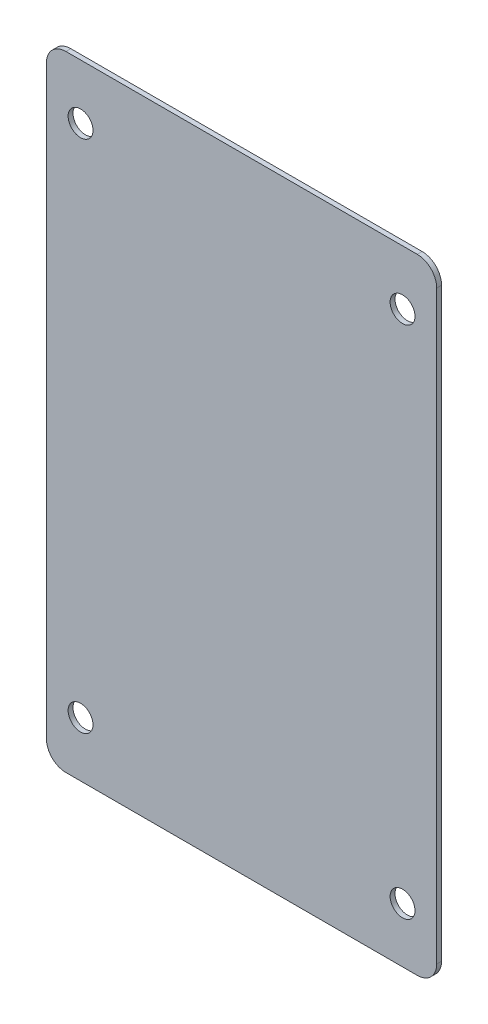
ISO-10303-21;
HEADER;
FILE_DESCRIPTION(('STEP AP214'),'2;1');
FILE_NAME('part.step','',(''),(''),'','','');
FILE_SCHEMA(('AUTOMOTIVE_DESIGN { 1 0 10303 214 1 1 1 1 }'));
ENDSEC;
DATA;
#1=APPLICATION_CONTEXT('core data for automotive mechanical design processes');
#2=APPLICATION_PROTOCOL_DEFINITION('international standard','automotive_design',2000,#1);
#3=PRODUCT_CONTEXT('',#1,'mechanical');
#4=PRODUCT('Part','Part','',(#3));
#5=PRODUCT_RELATED_PRODUCT_CATEGORY('part','',(#4));
#6=PRODUCT_DEFINITION_FORMATION('','',#4);
#7=PRODUCT_DEFINITION_CONTEXT('part definition',#1,'design');
#8=PRODUCT_DEFINITION('design','',#6,#7);
#9=PRODUCT_DEFINITION_SHAPE('','',#8);
#10=(LENGTH_UNIT() NAMED_UNIT(*) SI_UNIT(.MILLI.,.METRE.));
#11=(NAMED_UNIT(*) PLANE_ANGLE_UNIT() SI_UNIT($,.RADIAN.));
#12=(NAMED_UNIT(*) SI_UNIT($,.STERADIAN.) SOLID_ANGLE_UNIT());
#13=UNCERTAINTY_MEASURE_WITH_UNIT(LENGTH_MEASURE(1.E-05),#10,'distance_accuracy_value','');
#14=(GEOMETRIC_REPRESENTATION_CONTEXT(3) GLOBAL_UNCERTAINTY_ASSIGNED_CONTEXT((#13)) GLOBAL_UNIT_ASSIGNED_CONTEXT((#10,
#11,#12)) REPRESENTATION_CONTEXT('',''));
#15=CARTESIAN_POINT('',(0.,0.,0.));
#16=DIRECTION('',(0.,0.,1.));
#17=DIRECTION('',(1.,0.,0.));
#18=AXIS2_PLACEMENT_3D('',#15,#16,#17);
#19=CARTESIAN_POINT('',(40.,-64.,1.));
#20=DIRECTION('',(-1.,0.,0.));
#21=DIRECTION('',(0.,0.,1.));
#22=AXIS2_PLACEMENT_3D('',#19,#20,#21);
#23=PLANE('',#22);
#24=DIRECTION('',(0.,1.,0.));
#25=VECTOR('',#24,1.);
#26=CARTESIAN_POINT('',(40.,-64.,1.));
#27=LINE('',#26,#25);
#28=CARTESIAN_POINT('',(40.,-60.,1.));
#29=VERTEX_POINT('',#28);
#30=CARTESIAN_POINT('',(40.,60.,1.));
#31=VERTEX_POINT('',#30);
#32=EDGE_CURVE('E129',#29,#31,#27,.T.);
#33=ORIENTED_EDGE('',*,*,#32,.F.);
#34=DIRECTION('',(0.,0.,-1.));
#35=VECTOR('',#34,1.);
#36=CARTESIAN_POINT('',(40.,-60.,1.));
#37=LINE('',#36,#35);
#38=CARTESIAN_POINT('',(40.,-60.,0.));
#39=VERTEX_POINT('',#38);
#40=EDGE_CURVE('E11',#29,#39,#37,.T.);
#41=ORIENTED_EDGE('',*,*,#40,.T.);
#42=DIRECTION('',(0.,1.,0.));
#43=VECTOR('',#42,1.);
#44=CARTESIAN_POINT('',(40.,-64.,0.));
#45=LINE('',#44,#43);
#46=CARTESIAN_POINT('',(40.,60.,0.));
#47=VERTEX_POINT('',#46);
#48=EDGE_CURVE('E131',#39,#47,#45,.T.);
#49=ORIENTED_EDGE('',*,*,#48,.T.);
#50=DIRECTION('',(0.,0.,-1.));
#51=VECTOR('',#50,1.);
#52=CARTESIAN_POINT('',(40.,60.,1.));
#53=LINE('',#52,#51);
#54=EDGE_CURVE('E42',#47,#31,#53,.F.);
#55=ORIENTED_EDGE('',*,*,#54,.T.);
#56=EDGE_LOOP('',(#33,#41,#49,#55));
#57=FACE_BOUND('',#56,.T.);
#58=ADVANCED_FACE('F34',(#57),#23,.F.);
#59=CARTESIAN_POINT('',(-40.,64.,1.));
#60=DIRECTION('',(0.,-1.,0.));
#61=DIRECTION('',(0.,0.,-1.));
#62=AXIS2_PLACEMENT_3D('',#59,#60,#61);
#63=PLANE('',#62);
#64=DIRECTION('',(-1.,0.,0.));
#65=VECTOR('',#64,1.);
#66=CARTESIAN_POINT('',(-40.,64.,0.));
#67=LINE('',#66,#65);
#68=CARTESIAN_POINT('',(36.,64.,0.));
#69=VERTEX_POINT('',#68);
#70=CARTESIAN_POINT('',(-36.,64.,0.));
#71=VERTEX_POINT('',#70);
#72=EDGE_CURVE('E127',#69,#71,#67,.T.);
#73=ORIENTED_EDGE('',*,*,#72,.T.);
#74=DIRECTION('',(0.,0.,-1.));
#75=VECTOR('',#74,1.);
#76=CARTESIAN_POINT('',(-36.,64.,1.));
#77=LINE('',#76,#75);
#78=CARTESIAN_POINT('',(-36.,64.,1.));
#79=VERTEX_POINT('',#78);
#80=EDGE_CURVE('E106',#71,#79,#77,.F.);
#81=ORIENTED_EDGE('',*,*,#80,.T.);
#82=DIRECTION('',(-1.,0.,0.));
#83=VECTOR('',#82,1.);
#84=CARTESIAN_POINT('',(-40.,64.,1.));
#85=LINE('',#84,#83);
#86=CARTESIAN_POINT('',(36.,64.,1.));
#87=VERTEX_POINT('',#86);
#88=EDGE_CURVE('E167',#87,#79,#85,.T.);
#89=ORIENTED_EDGE('',*,*,#88,.F.);
#90=DIRECTION('',(0.,0.,-1.));
#91=VECTOR('',#90,1.);
#92=CARTESIAN_POINT('',(36.,64.,1.));
#93=LINE('',#92,#91);
#94=EDGE_CURVE('E111',#87,#69,#93,.T.);
#95=ORIENTED_EDGE('',*,*,#94,.T.);
#96=EDGE_LOOP('',(#73,#81,#89,#95));
#97=FACE_BOUND('',#96,.T.);
#98=ADVANCED_FACE('F171',(#97),#63,.F.);
#99=CARTESIAN_POINT('',(-40.,-64.,1.));
#100=DIRECTION('',(1.,0.,0.));
#101=DIRECTION('',(0.,0.,-1.));
#102=AXIS2_PLACEMENT_3D('',#99,#100,#101);
#103=PLANE('',#102);
#104=DIRECTION('',(0.,-1.,0.));
#105=VECTOR('',#104,1.);
#106=CARTESIAN_POINT('',(-40.,-64.,1.));
#107=LINE('',#106,#105);
#108=CARTESIAN_POINT('',(-40.,60.,1.));
#109=VERTEX_POINT('',#108);
#110=CARTESIAN_POINT('',(-40.,-60.,1.));
#111=VERTEX_POINT('',#110);
#112=EDGE_CURVE('E120',#109,#111,#107,.T.);
#113=ORIENTED_EDGE('',*,*,#112,.F.);
#114=DIRECTION('',(0.,0.,-1.));
#115=VECTOR('',#114,1.);
#116=CARTESIAN_POINT('',(-40.,60.,1.));
#117=LINE('',#116,#115);
#118=CARTESIAN_POINT('',(-40.,60.,0.));
#119=VERTEX_POINT('',#118);
#120=EDGE_CURVE('E105',#109,#119,#117,.T.);
#121=ORIENTED_EDGE('',*,*,#120,.T.);
#122=DIRECTION('',(0.,-1.,0.));
#123=VECTOR('',#122,1.);
#124=CARTESIAN_POINT('',(-40.,-64.,0.));
#125=LINE('',#124,#123);
#126=CARTESIAN_POINT('',(-40.,-60.,0.));
#127=VERTEX_POINT('',#126);
#128=EDGE_CURVE('E118',#119,#127,#125,.T.);
#129=ORIENTED_EDGE('',*,*,#128,.T.);
#130=DIRECTION('',(0.,0.,-1.));
#131=VECTOR('',#130,1.);
#132=CARTESIAN_POINT('',(-40.,-60.,1.));
#133=LINE('',#132,#131);
#134=EDGE_CURVE('E122',#127,#111,#133,.F.);
#135=ORIENTED_EDGE('',*,*,#134,.T.);
#136=EDGE_LOOP('',(#113,#121,#129,#135));
#137=FACE_BOUND('',#136,.T.);
#138=ADVANCED_FACE('F117',(#137),#103,.F.);
#139=CARTESIAN_POINT('',(-40.,-64.,1.));
#140=DIRECTION('',(0.,1.,0.));
#141=DIRECTION('',(0.,0.,1.));
#142=AXIS2_PLACEMENT_3D('',#139,#140,#141);
#143=PLANE('',#142);
#144=DIRECTION('',(1.,0.,0.));
#145=VECTOR('',#144,1.);
#146=CARTESIAN_POINT('',(-40.,-64.,1.));
#147=LINE('',#146,#145);
#148=CARTESIAN_POINT('',(-36.,-64.,1.));
#149=VERTEX_POINT('',#148);
#150=CARTESIAN_POINT('',(36.,-64.,1.));
#151=VERTEX_POINT('',#150);
#152=EDGE_CURVE('E135',#149,#151,#147,.T.);
#153=ORIENTED_EDGE('',*,*,#152,.F.);
#154=DIRECTION('',(0.,0.,-1.));
#155=VECTOR('',#154,1.);
#156=CARTESIAN_POINT('',(-36.,-64.,1.));
#157=LINE('',#156,#155);
#158=CARTESIAN_POINT('',(-36.,-64.,0.));
#159=VERTEX_POINT('',#158);
#160=EDGE_CURVE('E152',#149,#159,#157,.T.);
#161=ORIENTED_EDGE('',*,*,#160,.T.);
#162=DIRECTION('',(1.,0.,0.));
#163=VECTOR('',#162,1.);
#164=CARTESIAN_POINT('',(-40.,-64.,0.));
#165=LINE('',#164,#163);
#166=CARTESIAN_POINT('',(36.,-64.,0.));
#167=VERTEX_POINT('',#166);
#168=EDGE_CURVE('E126',#159,#167,#165,.T.);
#169=ORIENTED_EDGE('',*,*,#168,.T.);
#170=DIRECTION('',(0.,0.,-1.));
#171=VECTOR('',#170,1.);
#172=CARTESIAN_POINT('',(36.,-64.,1.));
#173=LINE('',#172,#171);
#174=EDGE_CURVE('E49',#167,#151,#173,.F.);
#175=ORIENTED_EDGE('',*,*,#174,.T.);
#176=EDGE_LOOP('',(#153,#161,#169,#175));
#177=FACE_BOUND('',#176,.T.);
#178=ADVANCED_FACE('F260',(#177),#143,.F.);
#179=CARTESIAN_POINT('',(0.,0.,1.));
#180=DIRECTION('',(0.,0.,-1.));
#181=DIRECTION('',(-1.,0.,0.));
#182=AXIS2_PLACEMENT_3D('',#179,#180,#181);
#183=PLANE('',#182);
#184=CARTESIAN_POINT('',(-33.,-52.7499999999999,1.));
#185=DIRECTION('',(0.,0.,-1.));
#186=DIRECTION('',(-1.,0.,0.));
#187=AXIS2_PLACEMENT_3D('',#184,#185,#186);
#188=CIRCLE('',#187,2.55);
#189=CARTESIAN_POINT('',(-35.55,-52.7499999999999,1.));
#190=VERTEX_POINT('',#189);
#191=EDGE_CURVE('E186',#190,#190,#188,.T.);
#192=ORIENTED_EDGE('',*,*,#191,.T.);
#193=EDGE_LOOP('',(#192));
#194=FACE_BOUND('',#193,.T.);
#195=CARTESIAN_POINT('',(-32.9999999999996,52.7500000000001,1.));
#196=DIRECTION('',(0.,0.,-1.));
#197=DIRECTION('',(-1.,0.,0.));
#198=AXIS2_PLACEMENT_3D('',#195,#196,#197);
#199=CIRCLE('',#198,2.55);
#200=CARTESIAN_POINT('',(-35.5499999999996,52.7500000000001,1.));
#201=VERTEX_POINT('',#200);
#202=EDGE_CURVE('E192',#201,#201,#199,.T.);
#203=ORIENTED_EDGE('',*,*,#202,.T.);
#204=EDGE_LOOP('',(#203));
#205=FACE_BOUND('',#204,.T.);
#206=CARTESIAN_POINT('',(33.0000000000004,52.7499999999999,1.));
#207=DIRECTION('',(0.,0.,-1.));
#208=DIRECTION('',(-1.,0.,0.));
#209=AXIS2_PLACEMENT_3D('',#206,#207,#208);
#210=CIRCLE('',#209,2.55);
#211=CARTESIAN_POINT('',(30.4500000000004,52.7499999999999,1.));
#212=VERTEX_POINT('',#211);
#213=EDGE_CURVE('E181',#212,#212,#210,.T.);
#214=ORIENTED_EDGE('',*,*,#213,.T.);
#215=EDGE_LOOP('',(#214));
#216=FACE_BOUND('',#215,.T.);
#217=CARTESIAN_POINT('',(33.,-52.7500000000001,1.));
#218=DIRECTION('',(0.,0.,-1.));
#219=DIRECTION('',(-1.,0.,0.));
#220=AXIS2_PLACEMENT_3D('',#217,#218,#219);
#221=CIRCLE('',#220,2.55);
#222=CARTESIAN_POINT('',(30.45,-52.7500000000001,1.));
#223=VERTEX_POINT('',#222);
#224=EDGE_CURVE('E172',#223,#223,#221,.T.);
#225=ORIENTED_EDGE('',*,*,#224,.T.);
#226=EDGE_LOOP('',(#225));
#227=FACE_BOUND('',#226,.T.);
#228=ORIENTED_EDGE('',*,*,#88,.T.);
#229=CARTESIAN_POINT('',(-36.,60.,1.));
#230=DIRECTION('',(0.,0.,-1.));
#231=DIRECTION('',(-1.,0.,0.));
#232=AXIS2_PLACEMENT_3D('',#229,#230,#231);
#233=CIRCLE('',#232,4.);
#234=EDGE_CURVE('E149',#79,#109,#233,.F.);
#235=ORIENTED_EDGE('',*,*,#234,.T.);
#236=ORIENTED_EDGE('',*,*,#112,.T.);
#237=CARTESIAN_POINT('',(-36.,-60.,1.));
#238=DIRECTION('',(0.,0.,-1.));
#239=DIRECTION('',(-1.,0.,0.));
#240=AXIS2_PLACEMENT_3D('',#237,#238,#239);
#241=CIRCLE('',#240,4.);
#242=EDGE_CURVE('E56',#111,#149,#241,.F.);
#243=ORIENTED_EDGE('',*,*,#242,.T.);
#244=ORIENTED_EDGE('',*,*,#152,.T.);
#245=CARTESIAN_POINT('',(36.,-60.,1.));
#246=DIRECTION('',(0.,0.,-1.));
#247=DIRECTION('',(-1.,0.,0.));
#248=AXIS2_PLACEMENT_3D('',#245,#246,#247);
#249=CIRCLE('',#248,4.);
#250=EDGE_CURVE('E146',#151,#29,#249,.F.);
#251=ORIENTED_EDGE('',*,*,#250,.T.);
#252=ORIENTED_EDGE('',*,*,#32,.T.);
#253=CARTESIAN_POINT('',(36.,60.,1.));
#254=DIRECTION('',(0.,0.,-1.));
#255=DIRECTION('',(-1.,0.,0.));
#256=AXIS2_PLACEMENT_3D('',#253,#254,#255);
#257=CIRCLE('',#256,4.);
#258=EDGE_CURVE('E144',#31,#87,#257,.F.);
#259=ORIENTED_EDGE('',*,*,#258,.T.);
#260=EDGE_LOOP('',(#228,#235,#236,#243,#244,#251,#252,#259));
#261=FACE_BOUND('',#260,.T.);
#262=ADVANCED_FACE('F164',(#194,#205,#216,#227,#261),#183,.F.);
#263=CARTESIAN_POINT('',(0.,0.,0.));
#264=DIRECTION('',(0.,0.,-1.));
#265=DIRECTION('',(-1.,0.,0.));
#266=AXIS2_PLACEMENT_3D('',#263,#264,#265);
#267=PLANE('',#266);
#268=CARTESIAN_POINT('',(-33.,-52.7499999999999,0.));
#269=DIRECTION('',(0.,0.,-1.));
#270=DIRECTION('',(-1.,0.,0.));
#271=AXIS2_PLACEMENT_3D('',#268,#269,#270);
#272=CIRCLE('',#271,2.55);
#273=CARTESIAN_POINT('',(-35.55,-52.7499999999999,0.));
#274=VERTEX_POINT('',#273);
#275=EDGE_CURVE('E183',#274,#274,#272,.T.);
#276=ORIENTED_EDGE('',*,*,#275,.F.);
#277=EDGE_LOOP('',(#276));
#278=FACE_BOUND('',#277,.T.);
#279=CARTESIAN_POINT('',(-32.9999999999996,52.7500000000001,0.));
#280=DIRECTION('',(0.,0.,-1.));
#281=DIRECTION('',(-1.,0.,0.));
#282=AXIS2_PLACEMENT_3D('',#279,#280,#281);
#283=CIRCLE('',#282,2.55);
#284=CARTESIAN_POINT('',(-35.5499999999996,52.7500000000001,0.));
#285=VERTEX_POINT('',#284);
#286=EDGE_CURVE('E189',#285,#285,#283,.T.);
#287=ORIENTED_EDGE('',*,*,#286,.F.);
#288=EDGE_LOOP('',(#287));
#289=FACE_BOUND('',#288,.T.);
#290=CARTESIAN_POINT('',(33.0000000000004,52.7499999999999,0.));
#291=DIRECTION('',(0.,0.,-1.));
#292=DIRECTION('',(-1.,0.,0.));
#293=AXIS2_PLACEMENT_3D('',#290,#291,#292);
#294=CIRCLE('',#293,2.55);
#295=CARTESIAN_POINT('',(30.4500000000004,52.7499999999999,0.));
#296=VERTEX_POINT('',#295);
#297=EDGE_CURVE('E195',#296,#296,#294,.T.);
#298=ORIENTED_EDGE('',*,*,#297,.F.);
#299=EDGE_LOOP('',(#298));
#300=FACE_BOUND('',#299,.T.);
#301=CARTESIAN_POINT('',(33.,-52.7500000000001,0.));
#302=DIRECTION('',(0.,0.,-1.));
#303=DIRECTION('',(-1.,0.,0.));
#304=AXIS2_PLACEMENT_3D('',#301,#302,#303);
#305=CIRCLE('',#304,2.55);
#306=CARTESIAN_POINT('',(30.45,-52.7500000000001,0.));
#307=VERTEX_POINT('',#306);
#308=EDGE_CURVE('E174',#307,#307,#305,.T.);
#309=ORIENTED_EDGE('',*,*,#308,.F.);
#310=EDGE_LOOP('',(#309));
#311=FACE_BOUND('',#310,.T.);
#312=ORIENTED_EDGE('',*,*,#128,.F.);
#313=CARTESIAN_POINT('',(-36.,60.,0.));
#314=DIRECTION('',(0.,0.,-1.));
#315=DIRECTION('',(-1.,0.,0.));
#316=AXIS2_PLACEMENT_3D('',#313,#314,#315);
#317=CIRCLE('',#316,4.);
#318=EDGE_CURVE('E101',#119,#71,#317,.T.);
#319=ORIENTED_EDGE('',*,*,#318,.T.);
#320=ORIENTED_EDGE('',*,*,#72,.F.);
#321=CARTESIAN_POINT('',(36.,60.,0.));
#322=DIRECTION('',(0.,0.,-1.));
#323=DIRECTION('',(-1.,0.,0.));
#324=AXIS2_PLACEMENT_3D('',#321,#322,#323);
#325=CIRCLE('',#324,4.);
#326=EDGE_CURVE('E121',#69,#47,#325,.T.);
#327=ORIENTED_EDGE('',*,*,#326,.T.);
#328=ORIENTED_EDGE('',*,*,#48,.F.);
#329=CARTESIAN_POINT('',(36.,-60.,0.));
#330=DIRECTION('',(0.,0.,-1.));
#331=DIRECTION('',(-1.,0.,0.));
#332=AXIS2_PLACEMENT_3D('',#329,#330,#331);
#333=CIRCLE('',#332,4.);
#334=EDGE_CURVE('E138',#39,#167,#333,.T.);
#335=ORIENTED_EDGE('',*,*,#334,.T.);
#336=ORIENTED_EDGE('',*,*,#168,.F.);
#337=CARTESIAN_POINT('',(-36.,-60.,0.));
#338=DIRECTION('',(0.,0.,-1.));
#339=DIRECTION('',(-1.,0.,0.));
#340=AXIS2_PLACEMENT_3D('',#337,#338,#339);
#341=CIRCLE('',#340,4.);
#342=EDGE_CURVE('E112',#159,#127,#341,.T.);
#343=ORIENTED_EDGE('',*,*,#342,.T.);
#344=EDGE_LOOP('',(#312,#319,#320,#327,#328,#335,#336,#343));
#345=FACE_BOUND('',#344,.T.);
#346=ADVANCED_FACE('F124',(#278,#289,#300,#311,#345),#267,.T.);
#347=CARTESIAN_POINT('',(-36.,60.,1.));
#348=DIRECTION('',(0.,0.,-1.));
#349=DIRECTION('',(-1.,0.,0.));
#350=AXIS2_PLACEMENT_3D('',#347,#348,#349);
#351=CYLINDRICAL_SURFACE('',#350,4.);
#352=ORIENTED_EDGE('',*,*,#234,.F.);
#353=ORIENTED_EDGE('',*,*,#80,.F.);
#354=ORIENTED_EDGE('',*,*,#318,.F.);
#355=ORIENTED_EDGE('',*,*,#120,.F.);
#356=EDGE_LOOP('',(#352,#353,#354,#355));
#357=FACE_BOUND('',#356,.T.);
#358=ADVANCED_FACE('F104',(#357),#351,.T.);
#359=CARTESIAN_POINT('',(-36.,-60.,1.));
#360=DIRECTION('',(0.,0.,-1.));
#361=DIRECTION('',(-1.,0.,0.));
#362=AXIS2_PLACEMENT_3D('',#359,#360,#361);
#363=CYLINDRICAL_SURFACE('',#362,4.);
#364=ORIENTED_EDGE('',*,*,#242,.F.);
#365=ORIENTED_EDGE('',*,*,#134,.F.);
#366=ORIENTED_EDGE('',*,*,#342,.F.);
#367=ORIENTED_EDGE('',*,*,#160,.F.);
#368=EDGE_LOOP('',(#364,#365,#366,#367));
#369=FACE_BOUND('',#368,.T.);
#370=ADVANCED_FACE('F237',(#369),#363,.T.);
#371=CARTESIAN_POINT('',(36.,-60.,1.));
#372=DIRECTION('',(0.,0.,-1.));
#373=DIRECTION('',(-1.,0.,0.));
#374=AXIS2_PLACEMENT_3D('',#371,#372,#373);
#375=CYLINDRICAL_SURFACE('',#374,4.);
#376=ORIENTED_EDGE('',*,*,#250,.F.);
#377=ORIENTED_EDGE('',*,*,#174,.F.);
#378=ORIENTED_EDGE('',*,*,#334,.F.);
#379=ORIENTED_EDGE('',*,*,#40,.F.);
#380=EDGE_LOOP('',(#376,#377,#378,#379));
#381=FACE_BOUND('',#380,.T.);
#382=ADVANCED_FACE('F223',(#381),#375,.T.);
#383=CARTESIAN_POINT('',(36.,60.,1.));
#384=DIRECTION('',(0.,0.,-1.));
#385=DIRECTION('',(-1.,0.,0.));
#386=AXIS2_PLACEMENT_3D('',#383,#384,#385);
#387=CYLINDRICAL_SURFACE('',#386,4.);
#388=ORIENTED_EDGE('',*,*,#258,.F.);
#389=ORIENTED_EDGE('',*,*,#54,.F.);
#390=ORIENTED_EDGE('',*,*,#326,.F.);
#391=ORIENTED_EDGE('',*,*,#94,.F.);
#392=EDGE_LOOP('',(#388,#389,#390,#391));
#393=FACE_BOUND('',#392,.T.);
#394=ADVANCED_FACE('F36',(#393),#387,.T.);
#395=CARTESIAN_POINT('',(33.,-52.7500000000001,1.));
#396=DIRECTION('',(0.,0.,-1.));
#397=DIRECTION('',(-1.,0.,0.));
#398=AXIS2_PLACEMENT_3D('',#395,#396,#397);
#399=CYLINDRICAL_SURFACE('',#398,2.55);
#400=ORIENTED_EDGE('',*,*,#224,.F.);
#401=EDGE_LOOP('',(#400));
#402=FACE_BOUND('',#401,.T.);
#403=ORIENTED_EDGE('',*,*,#308,.T.);
#404=EDGE_LOOP('',(#403));
#405=FACE_BOUND('',#404,.T.);
#406=ADVANCED_FACE('F207',(#402,#405),#399,.F.);
#407=CARTESIAN_POINT('',(33.0000000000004,52.7499999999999,1.));
#408=DIRECTION('',(0.,0.,-1.));
#409=DIRECTION('',(-1.,0.,0.));
#410=AXIS2_PLACEMENT_3D('',#407,#408,#409);
#411=CYLINDRICAL_SURFACE('',#410,2.55);
#412=ORIENTED_EDGE('',*,*,#213,.F.);
#413=EDGE_LOOP('',(#412));
#414=FACE_BOUND('',#413,.T.);
#415=ORIENTED_EDGE('',*,*,#297,.T.);
#416=EDGE_LOOP('',(#415));
#417=FACE_BOUND('',#416,.T.);
#418=ADVANCED_FACE('F203',(#414,#417),#411,.F.);
#419=CARTESIAN_POINT('',(-32.9999999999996,52.7500000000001,1.));
#420=DIRECTION('',(0.,0.,-1.));
#421=DIRECTION('',(-1.,0.,0.));
#422=AXIS2_PLACEMENT_3D('',#419,#420,#421);
#423=CYLINDRICAL_SURFACE('',#422,2.55);
#424=ORIENTED_EDGE('',*,*,#202,.F.);
#425=EDGE_LOOP('',(#424));
#426=FACE_BOUND('',#425,.T.);
#427=ORIENTED_EDGE('',*,*,#286,.T.);
#428=EDGE_LOOP('',(#427));
#429=FACE_BOUND('',#428,.T.);
#430=ADVANCED_FACE('F206',(#426,#429),#423,.F.);
#431=CARTESIAN_POINT('',(-33.,-52.7499999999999,1.));
#432=DIRECTION('',(0.,0.,-1.));
#433=DIRECTION('',(-1.,0.,0.));
#434=AXIS2_PLACEMENT_3D('',#431,#432,#433);
#435=CYLINDRICAL_SURFACE('',#434,2.55);
#436=ORIENTED_EDGE('',*,*,#191,.F.);
#437=EDGE_LOOP('',(#436));
#438=FACE_BOUND('',#437,.T.);
#439=ORIENTED_EDGE('',*,*,#275,.T.);
#440=EDGE_LOOP('',(#439));
#441=FACE_BOUND('',#440,.T.);
#442=ADVANCED_FACE('F287',(#438,#441),#435,.F.);
#443=CLOSED_SHELL('',(#58,#98,#138,#178,#262,#346,#358,#370,#382,#394,#406,#418,#430,#442));
#444=MANIFOLD_SOLID_BREP('B2',#443);
#445=ADVANCED_BREP_SHAPE_REPRESENTATION('',(#18,#444),#14);
#446=SHAPE_DEFINITION_REPRESENTATION(#9,#445);
ENDSEC;
END-ISO-10303-21;
